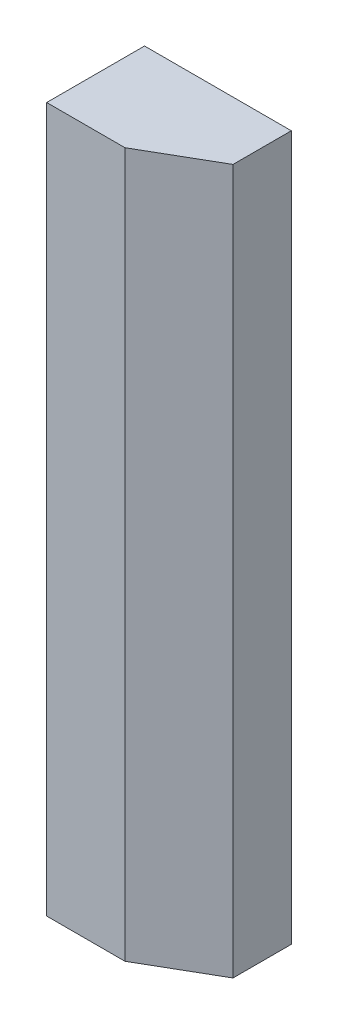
ISO-10303-21;
HEADER;
FILE_DESCRIPTION(('STEP AP214'),'2;1');
FILE_NAME('part.step','',(''),(''),'','','');
FILE_SCHEMA(('AUTOMOTIVE_DESIGN { 1 0 10303 214 1 1 1 1 }'));
ENDSEC;
DATA;
#1=APPLICATION_CONTEXT('core data for automotive mechanical design processes');
#2=APPLICATION_PROTOCOL_DEFINITION('international standard','automotive_design',2000,#1);
#3=PRODUCT_CONTEXT('',#1,'mechanical');
#4=PRODUCT('Part','Part','',(#3));
#5=PRODUCT_RELATED_PRODUCT_CATEGORY('part','',(#4));
#6=PRODUCT_DEFINITION_FORMATION('','',#4);
#7=PRODUCT_DEFINITION_CONTEXT('part definition',#1,'design');
#8=PRODUCT_DEFINITION('design','',#6,#7);
#9=PRODUCT_DEFINITION_SHAPE('','',#8);
#10=(LENGTH_UNIT() NAMED_UNIT(*) SI_UNIT(.MILLI.,.METRE.));
#11=(NAMED_UNIT(*) PLANE_ANGLE_UNIT() SI_UNIT($,.RADIAN.));
#12=(NAMED_UNIT(*) SI_UNIT($,.STERADIAN.) SOLID_ANGLE_UNIT());
#13=UNCERTAINTY_MEASURE_WITH_UNIT(LENGTH_MEASURE(1.E-05),#10,'distance_accuracy_value','');
#14=(GEOMETRIC_REPRESENTATION_CONTEXT(3) GLOBAL_UNCERTAINTY_ASSIGNED_CONTEXT((#13)) GLOBAL_UNIT_ASSIGNED_CONTEXT((#10,
#11,#12)) REPRESENTATION_CONTEXT('',''));
#15=CARTESIAN_POINT('',(0.,0.,0.));
#16=DIRECTION('',(0.,0.,1.));
#17=DIRECTION('',(1.,0.,0.));
#18=AXIS2_PLACEMENT_3D('',#15,#16,#17);
#19=CARTESIAN_POINT('',(-15.,144.,0.));
#20=DIRECTION('',(1.,0.,0.));
#21=DIRECTION('',(0.,0.,-1.));
#22=AXIS2_PLACEMENT_3D('',#19,#20,#21);
#23=PLANE('',#22);
#24=DIRECTION('',(0.,0.,1.));
#25=VECTOR('',#24,1.);
#26=CARTESIAN_POINT('',(-15.,0.,0.));
#27=LINE('',#26,#25);
#28=CARTESIAN_POINT('',(-15.,0.,-10.));
#29=VERTEX_POINT('',#28);
#30=CARTESIAN_POINT('',(-15.,0.,10.));
#31=VERTEX_POINT('',#30);
#32=EDGE_CURVE('E109',#29,#31,#27,.T.);
#33=ORIENTED_EDGE('',*,*,#32,.T.);
#34=DIRECTION('',(0.,-1.,0.));
#35=VECTOR('',#34,1.);
#36=CARTESIAN_POINT('',(-15.,144.,10.));
#37=LINE('',#36,#35);
#38=CARTESIAN_POINT('',(-15.,144.,10.));
#39=VERTEX_POINT('',#38);
#40=EDGE_CURVE('E11',#39,#31,#37,.T.);
#41=ORIENTED_EDGE('',*,*,#40,.F.);
#42=DIRECTION('',(0.,0.,1.));
#43=VECTOR('',#42,1.);
#44=CARTESIAN_POINT('',(-15.,144.,0.));
#45=LINE('',#44,#43);
#46=CARTESIAN_POINT('',(-15.,144.,-10.));
#47=VERTEX_POINT('',#46);
#48=EDGE_CURVE('E119',#47,#39,#45,.T.);
#49=ORIENTED_EDGE('',*,*,#48,.F.);
#50=DIRECTION('',(0.,-1.,0.));
#51=VECTOR('',#50,1.);
#52=CARTESIAN_POINT('',(-15.,144.,-10.));
#53=LINE('',#52,#51);
#54=EDGE_CURVE('E50',#47,#29,#53,.T.);
#55=ORIENTED_EDGE('',*,*,#54,.T.);
#56=EDGE_LOOP('',(#33,#41,#49,#55));
#57=FACE_BOUND('',#56,.T.);
#58=ADVANCED_FACE('F34',(#57),#23,.F.);
#59=CARTESIAN_POINT('',(0.,144.,10.));
#60=DIRECTION('',(0.,0.,-1.));
#61=DIRECTION('',(-1.,0.,0.));
#62=AXIS2_PLACEMENT_3D('',#59,#60,#61);
#63=PLANE('',#62);
#64=DIRECTION('',(1.,0.,0.));
#65=VECTOR('',#64,1.);
#66=CARTESIAN_POINT('',(0.,0.,10.));
#67=LINE('',#66,#65);
#68=CARTESIAN_POINT('',(0.999999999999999,0.,10.));
#69=VERTEX_POINT('',#68);
#70=EDGE_CURVE('E111',#31,#69,#67,.T.);
#71=ORIENTED_EDGE('',*,*,#70,.T.);
#72=DIRECTION('',(0.,-1.,0.));
#73=VECTOR('',#72,1.);
#74=CARTESIAN_POINT('',(0.999999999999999,144.,10.));
#75=LINE('',#74,#73);
#76=CARTESIAN_POINT('',(0.999999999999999,144.,10.));
#77=VERTEX_POINT('',#76);
#78=EDGE_CURVE('E42',#77,#69,#75,.T.);
#79=ORIENTED_EDGE('',*,*,#78,.F.);
#80=DIRECTION('',(1.,0.,0.));
#81=VECTOR('',#80,1.);
#82=CARTESIAN_POINT('',(0.,144.,10.));
#83=LINE('',#82,#81);
#84=EDGE_CURVE('E79',#39,#77,#83,.T.);
#85=ORIENTED_EDGE('',*,*,#84,.F.);
#86=ORIENTED_EDGE('',*,*,#40,.T.);
#87=EDGE_LOOP('',(#71,#79,#85,#86));
#88=FACE_BOUND('',#87,.T.);
#89=ADVANCED_FACE('F134',(#88),#63,.F.);
#90=CARTESIAN_POINT('',(4.58012701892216,144.,7.93301270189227));
#91=DIRECTION('',(-0.499999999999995,0.,-0.866025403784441));
#92=DIRECTION('',(-0.866025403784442,0.,0.499999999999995));
#93=AXIS2_PLACEMENT_3D('',#90,#91,#92);
#94=PLANE('',#93);
#95=DIRECTION('',(0.866025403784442,0.,-0.499999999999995));
#96=VECTOR('',#95,1.);
#97=CARTESIAN_POINT('',(4.58012701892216,0.,7.93301270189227));
#98=LINE('',#97,#96);
#99=CARTESIAN_POINT('',(15.,0.,1.91709623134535));
#100=VERTEX_POINT('',#99);
#101=EDGE_CURVE('E99',#69,#100,#98,.T.);
#102=ORIENTED_EDGE('',*,*,#101,.T.);
#103=DIRECTION('',(0.,-1.,0.));
#104=VECTOR('',#103,1.);
#105=CARTESIAN_POINT('',(15.,144.,1.91709623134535));
#106=LINE('',#105,#104);
#107=CARTESIAN_POINT('',(15.,144.,1.91709623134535));
#108=VERTEX_POINT('',#107);
#109=EDGE_CURVE('E96',#108,#100,#106,.T.);
#110=ORIENTED_EDGE('',*,*,#109,.F.);
#111=DIRECTION('',(0.866025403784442,0.,-0.499999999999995));
#112=VECTOR('',#111,1.);
#113=CARTESIAN_POINT('',(4.58012701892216,144.,7.93301270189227));
#114=LINE('',#113,#112);
#115=EDGE_CURVE('E86',#77,#108,#114,.T.);
#116=ORIENTED_EDGE('',*,*,#115,.F.);
#117=ORIENTED_EDGE('',*,*,#78,.T.);
#118=EDGE_LOOP('',(#102,#110,#116,#117));
#119=FACE_BOUND('',#118,.T.);
#120=ADVANCED_FACE('F97',(#119),#94,.F.);
#121=CARTESIAN_POINT('',(15.,144.,0.));
#122=DIRECTION('',(1.,0.,0.));
#123=DIRECTION('',(0.,0.,-1.));
#124=AXIS2_PLACEMENT_3D('',#121,#122,#123);
#125=PLANE('',#124);
#126=DIRECTION('',(0.,0.,1.));
#127=VECTOR('',#126,1.);
#128=CARTESIAN_POINT('',(15.,0.,0.));
#129=LINE('',#128,#127);
#130=CARTESIAN_POINT('',(15.,0.,-10.));
#131=VERTEX_POINT('',#130);
#132=EDGE_CURVE('E114',#131,#100,#129,.T.);
#133=ORIENTED_EDGE('',*,*,#132,.F.);
#134=DIRECTION('',(0.,-1.,0.));
#135=VECTOR('',#134,1.);
#136=CARTESIAN_POINT('',(15.,144.,-10.));
#137=LINE('',#136,#135);
#138=CARTESIAN_POINT('',(15.,144.,-10.));
#139=VERTEX_POINT('',#138);
#140=EDGE_CURVE('E67',#139,#131,#137,.T.);
#141=ORIENTED_EDGE('',*,*,#140,.F.);
#142=DIRECTION('',(0.,0.,1.));
#143=VECTOR('',#142,1.);
#144=CARTESIAN_POINT('',(15.,144.,0.));
#145=LINE('',#144,#143);
#146=EDGE_CURVE('E91',#139,#108,#145,.T.);
#147=ORIENTED_EDGE('',*,*,#146,.T.);
#148=ORIENTED_EDGE('',*,*,#109,.T.);
#149=EDGE_LOOP('',(#133,#141,#147,#148));
#150=FACE_BOUND('',#149,.T.);
#151=ADVANCED_FACE('F103',(#150),#125,.T.);
#152=CARTESIAN_POINT('',(0.,144.,-10.));
#153=DIRECTION('',(0.,0.,-1.));
#154=DIRECTION('',(-1.,0.,0.));
#155=AXIS2_PLACEMENT_3D('',#152,#153,#154);
#156=PLANE('',#155);
#157=DIRECTION('',(1.,0.,0.));
#158=VECTOR('',#157,1.);
#159=CARTESIAN_POINT('',(0.,0.,-10.));
#160=LINE('',#159,#158);
#161=EDGE_CURVE('E116',#29,#131,#160,.T.);
#162=ORIENTED_EDGE('',*,*,#161,.F.);
#163=ORIENTED_EDGE('',*,*,#54,.F.);
#164=DIRECTION('',(1.,0.,0.));
#165=VECTOR('',#164,1.);
#166=CARTESIAN_POINT('',(0.,144.,-10.));
#167=LINE('',#166,#165);
#168=EDGE_CURVE('E104',#47,#139,#167,.T.);
#169=ORIENTED_EDGE('',*,*,#168,.T.);
#170=ORIENTED_EDGE('',*,*,#140,.T.);
#171=EDGE_LOOP('',(#162,#163,#169,#170));
#172=FACE_BOUND('',#171,.T.);
#173=ADVANCED_FACE('F123',(#172),#156,.T.);
#174=CARTESIAN_POINT('',(0.,144.,0.));
#175=DIRECTION('',(0.,1.,0.));
#176=DIRECTION('',(0.,0.,1.));
#177=AXIS2_PLACEMENT_3D('',#174,#175,#176);
#178=PLANE('',#177);
#179=ORIENTED_EDGE('',*,*,#48,.T.);
#180=ORIENTED_EDGE('',*,*,#84,.T.);
#181=ORIENTED_EDGE('',*,*,#115,.T.);
#182=ORIENTED_EDGE('',*,*,#146,.F.);
#183=ORIENTED_EDGE('',*,*,#168,.F.);
#184=EDGE_LOOP('',(#179,#180,#181,#182,#183));
#185=FACE_BOUND('',#184,.T.);
#186=ADVANCED_FACE('F88',(#185),#178,.T.);
#187=CARTESIAN_POINT('',(0.,0.,0.));
#188=DIRECTION('',(0.,1.,0.));
#189=DIRECTION('',(0.,0.,1.));
#190=AXIS2_PLACEMENT_3D('',#187,#188,#189);
#191=PLANE('',#190);
#192=ORIENTED_EDGE('',*,*,#32,.F.);
#193=ORIENTED_EDGE('',*,*,#161,.T.);
#194=ORIENTED_EDGE('',*,*,#132,.T.);
#195=ORIENTED_EDGE('',*,*,#101,.F.);
#196=ORIENTED_EDGE('',*,*,#70,.F.);
#197=EDGE_LOOP('',(#192,#193,#194,#195,#196));
#198=FACE_BOUND('',#197,.T.);
#199=ADVANCED_FACE('F122',(#198),#191,.F.);
#200=CLOSED_SHELL('',(#58,#89,#120,#151,#173,#186,#199));
#201=MANIFOLD_SOLID_BREP('B2',#200);
#202=ADVANCED_BREP_SHAPE_REPRESENTATION('',(#18,#201),#14);
#203=SHAPE_DEFINITION_REPRESENTATION(#9,#202);
ENDSEC;
END-ISO-10303-21;
